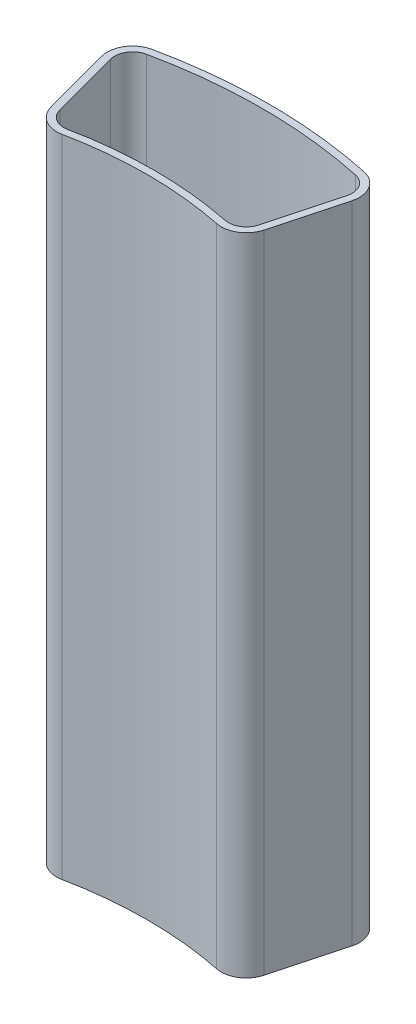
from build123d import *

# Parameters (mm, degrees)
BOSS_EXTRUDE1_DEPTH = 180
FILLET1_R           = 7
SHELL1_T            = -2


with BuildPart() as part:
    # Sketch1 → Boss-Extrude1 (new body)
    with BuildSketch(Plane(origin=(0, 0, 0), x_dir=(1, 0, 0), z_dir=(0, 1, 0))):
        with BuildLine():
            Line((-27.952456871, 104.319989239), (-36.752304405, 137.161467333))
            ThreePointArc((-36.752304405, 137.161467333), (0, 142), (36.752304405, 137.161467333))
            Line((36.752304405, 137.161467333), (27.952456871, 104.319989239))
            ThreePointArc((27.952456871, 104.319989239), (0, 108), (-27.952456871, 104.319989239))
        make_face()
    extrude(amount=BOSS_EXTRUDE1_DEPTH)

    # Fillet1
    fillet1_edges = [part.edges().sort_by_distance(p)[0] for p in [
        (-27.952456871, 90, -104.319989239),
        (-36.752304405, 90, -137.161467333),
        (36.752304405, 90, -137.161467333),
        (27.952456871, 90, -104.319989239),
    ]]
    fillet(fillet1_edges, radius=FILLET1_R)

    # Shell1
    shell1_openings = [part.faces().sort_by_distance(p)[0] for p in [
        (0, 180, -124.376170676),
        (0, 0, -124.376170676),
    ]]
    offset(amount=SHELL1_T, openings=shell1_openings, kind=Kind.INTERSECTION)


solid = part.part
